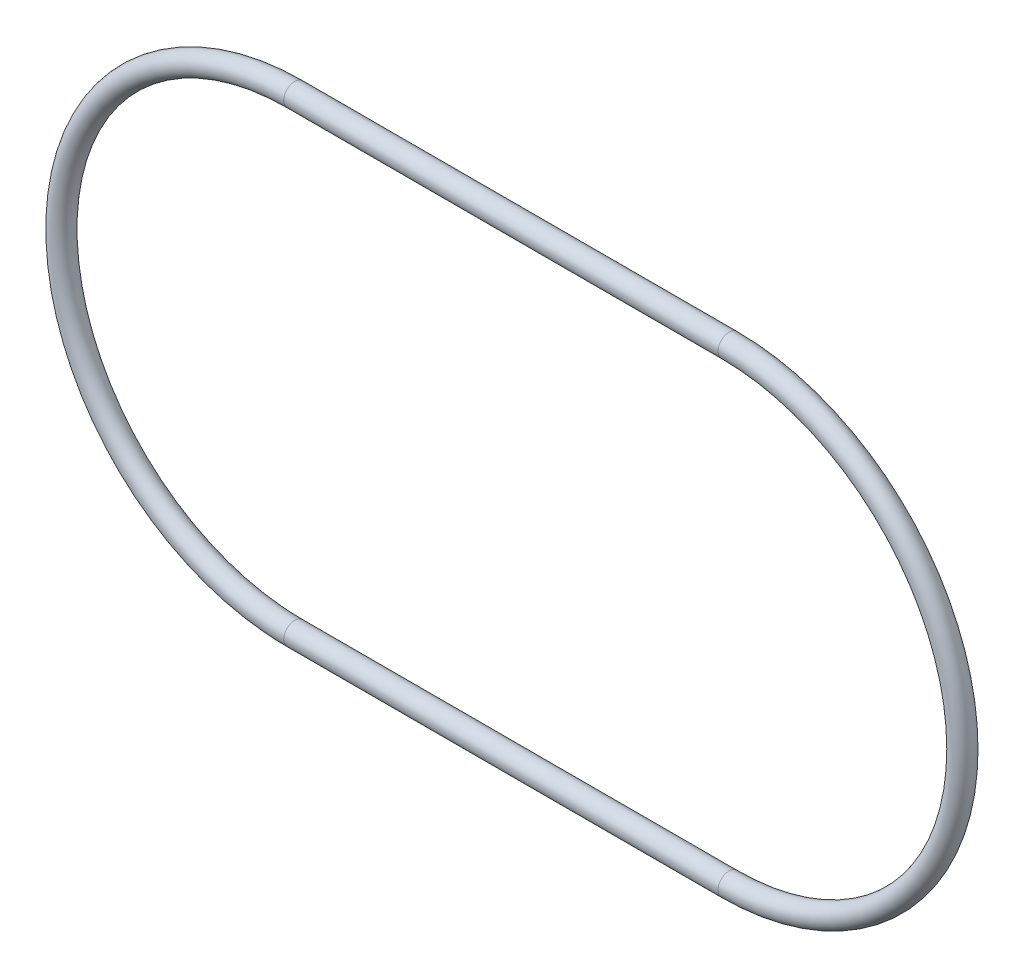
ISO-10303-21;
HEADER;
FILE_DESCRIPTION(('STEP AP214'),'2;1');
FILE_NAME('part.step','',(''),(''),'','','');
FILE_SCHEMA(('AUTOMOTIVE_DESIGN { 1 0 10303 214 1 1 1 1 }'));
ENDSEC;
DATA;
#1=APPLICATION_CONTEXT('core data for automotive mechanical design processes');
#2=APPLICATION_PROTOCOL_DEFINITION('international standard','automotive_design',2000,#1);
#3=PRODUCT_CONTEXT('',#1,'mechanical');
#4=PRODUCT('Part','Part','',(#3));
#5=PRODUCT_RELATED_PRODUCT_CATEGORY('part','',(#4));
#6=PRODUCT_DEFINITION_FORMATION('','',#4);
#7=PRODUCT_DEFINITION_CONTEXT('part definition',#1,'design');
#8=PRODUCT_DEFINITION('design','',#6,#7);
#9=PRODUCT_DEFINITION_SHAPE('','',#8);
#10=(LENGTH_UNIT() NAMED_UNIT(*) SI_UNIT(.MILLI.,.METRE.));
#11=(NAMED_UNIT(*) PLANE_ANGLE_UNIT() SI_UNIT($,.RADIAN.));
#12=(NAMED_UNIT(*) SI_UNIT($,.STERADIAN.) SOLID_ANGLE_UNIT());
#13=UNCERTAINTY_MEASURE_WITH_UNIT(LENGTH_MEASURE(1.E-05),#10,'distance_accuracy_value','');
#14=(GEOMETRIC_REPRESENTATION_CONTEXT(3) GLOBAL_UNCERTAINTY_ASSIGNED_CONTEXT((#13)) GLOBAL_UNIT_ASSIGNED_CONTEXT((#10,
#11,#12)) REPRESENTATION_CONTEXT('',''));
#15=CARTESIAN_POINT('',(0.,0.,0.));
#16=DIRECTION('',(0.,0.,1.));
#17=DIRECTION('',(1.,0.,0.));
#18=AXIS2_PLACEMENT_3D('',#15,#16,#17);
#19=CARTESIAN_POINT('',(58.9999999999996,-31.7,0.));
#20=DIRECTION('',(-1.,0.,0.));
#21=DIRECTION('',(0.,-1.,0.));
#22=AXIS2_PLACEMENT_3D('',#19,#20,#21);
#23=CYLINDRICAL_SURFACE('',#22,1.5);
#24=CARTESIAN_POINT('',(58.9999999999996,-31.7,0.));
#25=DIRECTION('',(1.,0.,0.));
#26=DIRECTION('',(0.,0.,-1.));
#27=AXIS2_PLACEMENT_3D('',#24,#25,#26);
#28=CIRCLE('',#27,1.5);
#29=CARTESIAN_POINT('',(58.9999999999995,-33.2,0.));
#30=VERTEX_POINT('',#29);
#31=EDGE_CURVE('E41',#30,#30,#28,.T.);
#32=ORIENTED_EDGE('',*,*,#31,.F.);
#33=EDGE_LOOP('',(#32));
#34=FACE_BOUND('',#33,.T.);
#35=CARTESIAN_POINT('',(-4.37150315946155E-13,-31.7,0.));
#36=DIRECTION('',(1.,0.,0.));
#37=DIRECTION('',(0.,0.,-1.));
#38=AXIS2_PLACEMENT_3D('',#35,#36,#37);
#39=CIRCLE('',#38,1.5);
#40=CARTESIAN_POINT('',(-4.37150315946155E-13,-31.7,-1.5));
#41=VERTEX_POINT('',#40);
#42=EDGE_CURVE('E10',#41,#41,#39,.T.);
#43=ORIENTED_EDGE('',*,*,#42,.T.);
#44=EDGE_LOOP('',(#43));
#45=FACE_BOUND('',#44,.T.);
#46=ADVANCED_FACE('F31',(#34,#45),#23,.T.);
#47=CARTESIAN_POINT('',(59.,0.,0.));
#48=DIRECTION('',(0.,0.,-1.));
#49=DIRECTION('',(-1.,0.,0.));
#50=AXIS2_PLACEMENT_3D('',#47,#48,#49);
#51=TOROIDAL_SURFACE('',#50,31.7,1.5);
#52=CARTESIAN_POINT('',(59.,31.7,0.));
#53=DIRECTION('',(-1.,0.,0.));
#54=DIRECTION('',(0.,0.,-1.));
#55=AXIS2_PLACEMENT_3D('',#52,#53,#54);
#56=CIRCLE('',#55,1.5);
#57=CARTESIAN_POINT('',(59.,33.2,0.));
#58=VERTEX_POINT('',#57);
#59=EDGE_CURVE('E46',#58,#58,#56,.T.);
#60=CARTESIAN_POINT('',(59.,0.,0.));
#61=DIRECTION('',(0.,0.,-1.));
#62=DIRECTION('',(-1.,0.,0.));
#63=AXIS2_PLACEMENT_3D('',#60,#61,#62);
#64=CIRCLE('',#63,33.2);
#65=EDGE_CURVE('',#58,#30,#64,.T.);
#66=ORIENTED_EDGE('',*,*,#59,.F.);
#67=ORIENTED_EDGE('',*,*,#31,.T.);
#68=ORIENTED_EDGE('',*,*,#65,.T.);
#69=ORIENTED_EDGE('',*,*,#65,.F.);
#70=EDGE_LOOP('',(#66,#68,#67,#69));
#71=FACE_BOUND('',#70,.T.);
#72=ADVANCED_FACE('F70',(#71),#51,.T.);
#73=CARTESIAN_POINT('',(0.,31.7,0.));
#74=DIRECTION('',(1.,0.,0.));
#75=DIRECTION('',(0.,1.,0.));
#76=AXIS2_PLACEMENT_3D('',#73,#74,#75);
#77=CYLINDRICAL_SURFACE('',#76,1.5);
#78=CARTESIAN_POINT('',(0.,31.7,0.));
#79=DIRECTION('',(-1.,0.,0.));
#80=DIRECTION('',(0.,0.,-1.));
#81=AXIS2_PLACEMENT_3D('',#78,#79,#80);
#82=CIRCLE('',#81,1.5);
#83=CARTESIAN_POINT('',(0.,31.7,-1.5));
#84=VERTEX_POINT('',#83);
#85=EDGE_CURVE('E51',#84,#84,#82,.T.);
#86=ORIENTED_EDGE('',*,*,#85,.F.);
#87=EDGE_LOOP('',(#86));
#88=FACE_BOUND('',#87,.T.);
#89=ORIENTED_EDGE('',*,*,#59,.T.);
#90=EDGE_LOOP('',(#89));
#91=FACE_BOUND('',#90,.T.);
#92=ADVANCED_FACE('F65',(#88,#91),#77,.T.);
#93=CARTESIAN_POINT('',(0.,0.,0.));
#94=DIRECTION('',(0.,0.,1.));
#95=DIRECTION('',(1.,0.,0.));
#96=AXIS2_PLACEMENT_3D('',#93,#94,#95);
#97=TOROIDAL_SURFACE('',#96,31.7,1.5);
#98=ORIENTED_EDGE('',*,*,#85,.T.);
#99=EDGE_LOOP('',(#98));
#100=FACE_BOUND('',#99,.T.);
#101=ORIENTED_EDGE('',*,*,#42,.F.);
#102=EDGE_LOOP('',(#101));
#103=FACE_BOUND('',#102,.T.);
#104=ADVANCED_FACE('F63',(#100,#103),#97,.T.);
#105=CLOSED_SHELL('',(#46,#72,#92,#104));
#106=MANIFOLD_SOLID_BREP('B2',#105);
#107=ADVANCED_BREP_SHAPE_REPRESENTATION('',(#18,#106),#14);
#108=SHAPE_DEFINITION_REPRESENTATION(#9,#107);
ENDSEC;
END-ISO-10303-21;
